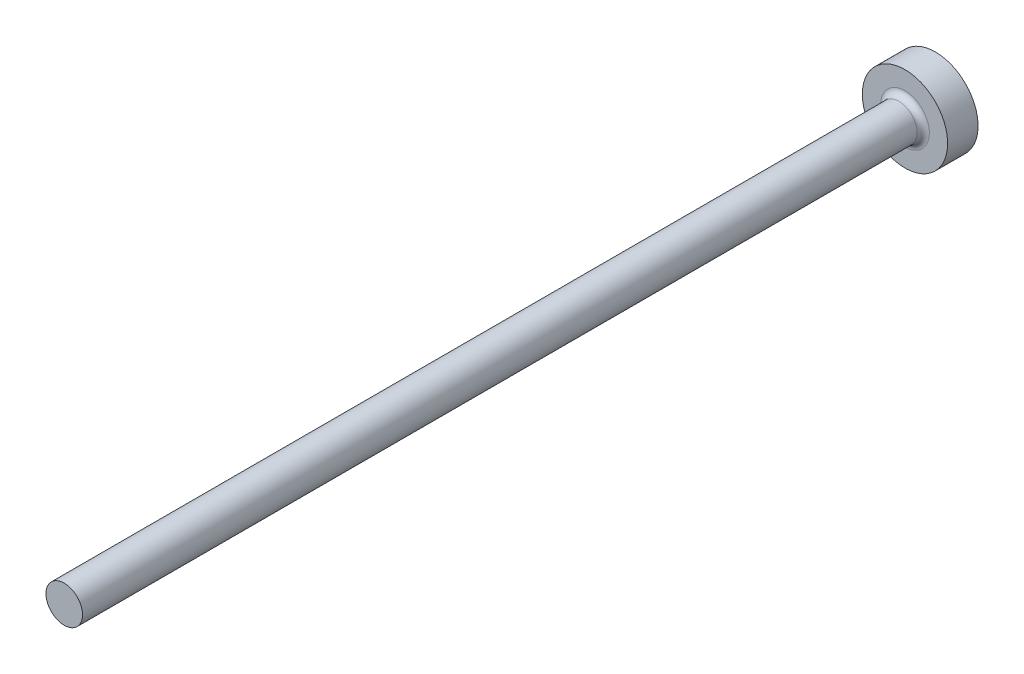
ISO-10303-21;
HEADER;
FILE_DESCRIPTION(('STEP AP214'),'2;1');
FILE_NAME('part.step','',(''),(''),'','','');
FILE_SCHEMA(('AUTOMOTIVE_DESIGN { 1 0 10303 214 1 1 1 1 }'));
ENDSEC;
DATA;
#1=APPLICATION_CONTEXT('core data for automotive mechanical design processes');
#2=APPLICATION_PROTOCOL_DEFINITION('international standard','automotive_design',2000,#1);
#3=PRODUCT_CONTEXT('',#1,'mechanical');
#4=PRODUCT('Part','Part','',(#3));
#5=PRODUCT_RELATED_PRODUCT_CATEGORY('part','',(#4));
#6=PRODUCT_DEFINITION_FORMATION('','',#4);
#7=PRODUCT_DEFINITION_CONTEXT('part definition',#1,'design');
#8=PRODUCT_DEFINITION('design','',#6,#7);
#9=PRODUCT_DEFINITION_SHAPE('','',#8);
#10=(LENGTH_UNIT() NAMED_UNIT(*) SI_UNIT(.MILLI.,.METRE.));
#11=(NAMED_UNIT(*) PLANE_ANGLE_UNIT() SI_UNIT($,.RADIAN.));
#12=(NAMED_UNIT(*) SI_UNIT($,.STERADIAN.) SOLID_ANGLE_UNIT());
#13=UNCERTAINTY_MEASURE_WITH_UNIT(LENGTH_MEASURE(1.E-05),#10,'distance_accuracy_value','');
#14=(GEOMETRIC_REPRESENTATION_CONTEXT(3) GLOBAL_UNCERTAINTY_ASSIGNED_CONTEXT((#13)) GLOBAL_UNIT_ASSIGNED_CONTEXT((#10,
#11,#12)) REPRESENTATION_CONTEXT('',''));
#15=CARTESIAN_POINT('',(0.,0.,0.));
#16=DIRECTION('',(0.,0.,1.));
#17=DIRECTION('',(1.,0.,0.));
#18=AXIS2_PLACEMENT_3D('',#15,#16,#17);
#19=CARTESIAN_POINT('',(-38.25,50.745,-138.));
#20=DIRECTION('',(0.,0.,-1.));
#21=DIRECTION('',(-1.,0.,0.));
#22=AXIS2_PLACEMENT_3D('',#19,#20,#21);
#23=PLANE('',#22);
#24=CARTESIAN_POINT('',(-38.25,50.745,-138.));
#25=DIRECTION('',(0.,0.,-1.));
#26=DIRECTION('',(-1.,0.,0.));
#27=AXIS2_PLACEMENT_3D('',#24,#25,#26);
#28=CIRCLE('',#27,4.);
#29=CARTESIAN_POINT('',(-42.25,50.745,-138.));
#30=VERTEX_POINT('',#29);
#31=EDGE_CURVE('E10',#30,#30,#28,.T.);
#32=ORIENTED_EDGE('',*,*,#31,.T.);
#33=EDGE_LOOP('',(#32));
#34=FACE_BOUND('',#33,.T.);
#35=CARTESIAN_POINT('',(-38.25,50.745,-138.));
#36=DIRECTION('',(0.,0.,-1.));
#37=DIRECTION('',(-1.,0.,0.));
#38=AXIS2_PLACEMENT_3D('',#35,#36,#37);
#39=CIRCLE('',#38,7.);
#40=CARTESIAN_POINT('',(-45.25,50.745,-138.));
#41=VERTEX_POINT('',#40);
#42=EDGE_CURVE('E43',#41,#41,#39,.T.);
#43=ORIENTED_EDGE('',*,*,#42,.F.);
#44=EDGE_LOOP('',(#43));
#45=FACE_BOUND('',#44,.T.);
#46=ADVANCED_FACE('F32',(#34,#45),#23,.F.);
#47=CARTESIAN_POINT('',(-38.25,50.745,-138.));
#48=DIRECTION('',(0.,0.,-1.));
#49=DIRECTION('',(-1.,0.,0.));
#50=AXIS2_PLACEMENT_3D('',#47,#48,#49);
#51=CYLINDRICAL_SURFACE('',#50,7.);
#52=ORIENTED_EDGE('',*,*,#42,.T.);
#53=EDGE_LOOP('',(#52));
#54=FACE_BOUND('',#53,.T.);
#55=CARTESIAN_POINT('',(-38.25,50.745,-143.));
#56=DIRECTION('',(0.,0.,-1.));
#57=DIRECTION('',(-1.,0.,0.));
#58=AXIS2_PLACEMENT_3D('',#55,#56,#57);
#59=CIRCLE('',#58,7.);
#60=CARTESIAN_POINT('',(-45.25,50.745,-143.));
#61=VERTEX_POINT('',#60);
#62=EDGE_CURVE('E47',#61,#61,#59,.T.);
#63=ORIENTED_EDGE('',*,*,#62,.F.);
#64=EDGE_LOOP('',(#63));
#65=FACE_BOUND('',#64,.T.);
#66=ADVANCED_FACE('F69',(#54,#65),#51,.T.);
#67=CARTESIAN_POINT('',(-38.25,50.745,-143.));
#68=DIRECTION('',(0.,0.,-1.));
#69=DIRECTION('',(-1.,0.,0.));
#70=AXIS2_PLACEMENT_3D('',#67,#68,#69);
#71=PLANE('',#70);
#72=ORIENTED_EDGE('',*,*,#62,.T.);
#73=EDGE_LOOP('',(#72));
#74=FACE_BOUND('',#73,.T.);
#75=ADVANCED_FACE('F66',(#74),#71,.T.);
#76=CARTESIAN_POINT('',(-38.25,50.745,0.000399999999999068));
#77=DIRECTION('',(0.,0.,-1.));
#78=DIRECTION('',(-1.,0.,0.));
#79=AXIS2_PLACEMENT_3D('',#76,#77,#78);
#80=PLANE('',#79);
#81=CARTESIAN_POINT('',(-38.25,50.745,0.000399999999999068));
#82=DIRECTION('',(0.,0.,1.));
#83=DIRECTION('',(1.,0.,0.));
#84=AXIS2_PLACEMENT_3D('',#81,#82,#83);
#85=CIRCLE('',#84,3.);
#86=CARTESIAN_POINT('',(-35.25,50.745,0.000399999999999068));
#87=VERTEX_POINT('',#86);
#88=EDGE_CURVE('E51',#87,#87,#85,.T.);
#89=ORIENTED_EDGE('',*,*,#88,.T.);
#90=EDGE_LOOP('',(#89));
#91=FACE_BOUND('',#90,.T.);
#92=ADVANCED_FACE('F56',(#91),#80,.F.);
#93=CARTESIAN_POINT('',(-38.25,50.745,-149.313708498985));
#94=DIRECTION('',(0.,0.,1.));
#95=DIRECTION('',(1.,0.,0.));
#96=AXIS2_PLACEMENT_3D('',#93,#94,#95);
#97=CYLINDRICAL_SURFACE('',#96,3.);
#98=CARTESIAN_POINT('',(-38.25,50.745,-137.));
#99=DIRECTION('',(0.,0.,-1.));
#100=DIRECTION('',(-1.,0.,0.));
#101=AXIS2_PLACEMENT_3D('',#98,#99,#100);
#102=CIRCLE('',#101,3.);
#103=CARTESIAN_POINT('',(-41.25,50.745,-137.));
#104=VERTEX_POINT('',#103);
#105=EDGE_CURVE('E39',#104,#104,#102,.F.);
#106=ORIENTED_EDGE('',*,*,#105,.T.);
#107=EDGE_LOOP('',(#106));
#108=FACE_BOUND('',#107,.T.);
#109=ORIENTED_EDGE('',*,*,#88,.F.);
#110=EDGE_LOOP('',(#109));
#111=FACE_BOUND('',#110,.T.);
#112=ADVANCED_FACE('F58',(#108,#111),#97,.T.);
#113=CARTESIAN_POINT('',(-38.25,50.745,-137.));
#114=DIRECTION('',(0.,0.,-1.));
#115=DIRECTION('',(-1.,0.,0.));
#116=AXIS2_PLACEMENT_3D('',#113,#114,#115);
#117=TOROIDAL_SURFACE('',#116,4.,1.);
#118=ORIENTED_EDGE('',*,*,#31,.F.);
#119=EDGE_LOOP('',(#118));
#120=FACE_BOUND('',#119,.T.);
#121=ORIENTED_EDGE('',*,*,#105,.F.);
#122=EDGE_LOOP('',(#121));
#123=FACE_BOUND('',#122,.T.);
#124=ADVANCED_FACE('F34',(#120,#123),#117,.F.);
#125=CLOSED_SHELL('',(#46,#66,#75,#92,#112,#124));
#126=MANIFOLD_SOLID_BREP('B2',#125);
#127=ADVANCED_BREP_SHAPE_REPRESENTATION('',(#18,#126),#14);
#128=SHAPE_DEFINITION_REPRESENTATION(#9,#127);
ENDSEC;
END-ISO-10303-21;
